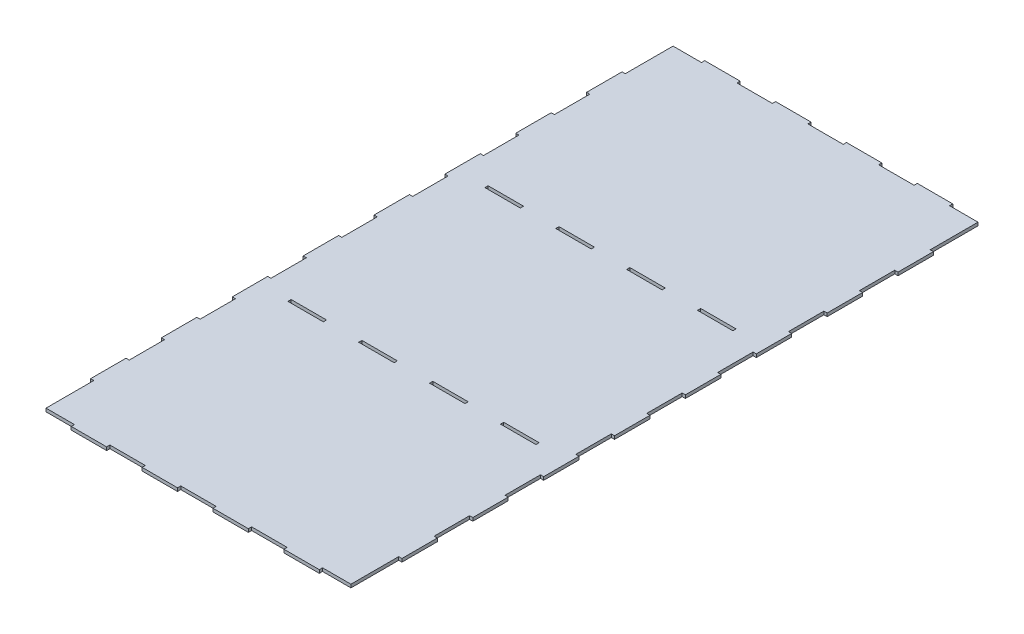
from build123d import *

# Parameters (mm, degrees)
SKETCH1_W           = 33
SKETCH1_H           = 3
BOSS_EXTRUDE1_DEPTH = 3


with BuildPart() as part:
    # Sketch1 → Boss-Extrude1 (new body)
    with BuildSketch(Plane(origin=(0, 0, 0), x_dir=(1, 0, 0), z_dir=(0, 1, 0))):
        Polygon((889, 590), (889, 545.5), (886, 545.5), (886, 512.5), (889, 512.5), (889, 479.5), (886, 479.5), (886, 446.5), (889, 446.5), (889, 413.5), (886, 413.5), (886, 380.5), (889, 380.5), (889, 347.5), (886, 347.5), (886, 314.5), (889, 314.5), (889, 281.5), (886, 281.5), (886, 248.5), (889, 248.5), (889, 215.5), (886, 215.5), (886, 182.5), (889, 182.5), (889, 149.5), (886, 149.5), (886, 116.5), (889, 116.5), (889, 83.5), (886, 83.5), (886, 50.5), (889, 50.5), (889, 17.5), (889, 6), (915.5, 6), (915.5, 3), (948.5, 3), (948.5, 6), (981.5, 6), (981.5, 3), (1014.5, 3), (1014.5, 6), (1047.5, 6), (1047.5, 3), (1080.5, 3), (1080.5, 6), (1113.5, 6), (1113.5, 3), (1146.5, 3), (1146.5, 6), (1173, 6), (1173, 50.5), (1176, 50.5), (1176, 83.5), (1173, 83.5), (1173, 116.5), (1176, 116.5), (1176, 149.5), (1173, 149.5), (1173, 182.5), (1176, 182.5), (1176, 215.5), (1173, 215.5), (1173, 248.5), (1176, 248.5), (1176, 281.5), (1173, 281.5), (1173, 314.5), (1176, 314.5), (1176, 347.5), (1173, 347.5), (1173, 380.5), (1176, 380.5), (1176, 413.5), (1173, 413.5), (1173, 446.5), (1176, 446.5), (1176, 479.5), (1173, 479.5), (1173, 512.5), (1176, 512.5), (1176, 545.5), (1173, 545.5), (1173, 578.5), (1173, 590), (1146.5, 590), (1146.5, 593), (1113.5, 593), (1113.5, 590), (1080.5, 590), (1080.5, 593), (1047.5, 593), (1047.5, 590), (1014.5, 590), (1014.5, 593), (981.5, 593), (981.5, 590), (948.5, 590), (948.5, 593), (915.5, 593), (915.5, 590), align=None)
        with Locations((932, 206.25)):
            Rectangle(SKETCH1_W, SKETCH1_H, mode=Mode.SUBTRACT)
        with Locations((932, 389.75)):
            Rectangle(SKETCH1_W, SKETCH1_H, mode=Mode.SUBTRACT)
        with Locations((998, 389.75)):
            Rectangle(SKETCH1_W, SKETCH1_H, mode=Mode.SUBTRACT)
        with Locations((1064, 389.75)):
            Rectangle(SKETCH1_W, SKETCH1_H, mode=Mode.SUBTRACT)
        with Locations((1130, 389.75)):
            Rectangle(SKETCH1_W, SKETCH1_H, mode=Mode.SUBTRACT)
        with Locations((998, 206.25)):
            Rectangle(SKETCH1_W, SKETCH1_H, mode=Mode.SUBTRACT)
        with Locations((1064, 206.25)):
            Rectangle(SKETCH1_W, SKETCH1_H, mode=Mode.SUBTRACT)
        with Locations((1130, 206.25)):
            Rectangle(SKETCH1_W, SKETCH1_H, mode=Mode.SUBTRACT)
    extrude(amount=BOSS_EXTRUDE1_DEPTH)


solid = part.part
